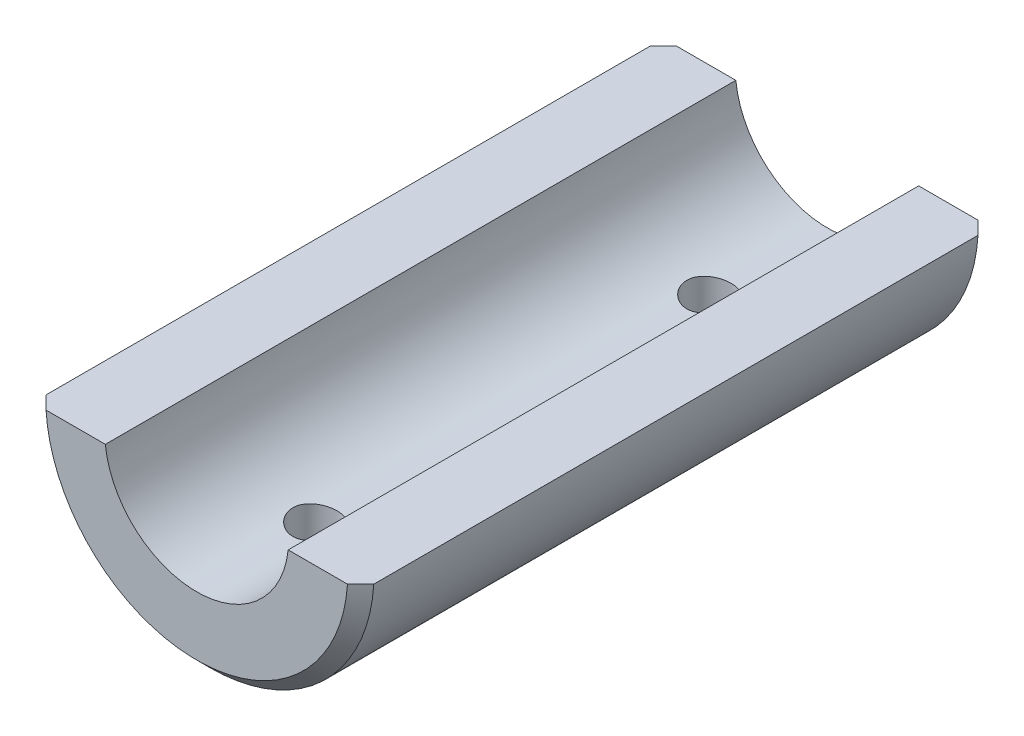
ISO-10303-21;
HEADER;
FILE_DESCRIPTION(('STEP AP214'),'2;1');
FILE_NAME('part.step','',(''),(''),'','','');
FILE_SCHEMA(('AUTOMOTIVE_DESIGN { 1 0 10303 214 1 1 1 1 }'));
ENDSEC;
DATA;
#1=APPLICATION_CONTEXT('core data for automotive mechanical design processes');
#2=APPLICATION_PROTOCOL_DEFINITION('international standard','automotive_design',2000,#1);
#3=PRODUCT_CONTEXT('',#1,'mechanical');
#4=PRODUCT('Part','Part','',(#3));
#5=PRODUCT_RELATED_PRODUCT_CATEGORY('part','',(#4));
#6=PRODUCT_DEFINITION_FORMATION('','',#4);
#7=PRODUCT_DEFINITION_CONTEXT('part definition',#1,'design');
#8=PRODUCT_DEFINITION('design','',#6,#7);
#9=PRODUCT_DEFINITION_SHAPE('','',#8);
#10=(LENGTH_UNIT() NAMED_UNIT(*) SI_UNIT(.MILLI.,.METRE.));
#11=(NAMED_UNIT(*) PLANE_ANGLE_UNIT() SI_UNIT($,.RADIAN.));
#12=(NAMED_UNIT(*) SI_UNIT($,.STERADIAN.) SOLID_ANGLE_UNIT());
#13=UNCERTAINTY_MEASURE_WITH_UNIT(LENGTH_MEASURE(1.E-05),#10,'distance_accuracy_value','');
#14=(GEOMETRIC_REPRESENTATION_CONTEXT(3) GLOBAL_UNCERTAINTY_ASSIGNED_CONTEXT((#13)) GLOBAL_UNIT_ASSIGNED_CONTEXT((#10,
#11,#12)) REPRESENTATION_CONTEXT('',''));
#15=CARTESIAN_POINT('',(0.,0.,0.));
#16=DIRECTION('',(0.,0.,1.));
#17=DIRECTION('',(1.,0.,0.));
#18=AXIS2_PLACEMENT_3D('',#15,#16,#17);
#19=CARTESIAN_POINT('',(0.,0.,96.));
#20=DIRECTION('',(0.,0.,-1.));
#21=DIRECTION('',(-1.,0.,0.));
#22=AXIS2_PLACEMENT_3D('',#19,#20,#21);
#23=CYLINDRICAL_SURFACE('',#22,14.);
#24=CARTESIAN_POINT('',(0.,-14.,21.375));
#25=CARTESIAN_POINT('',(-0.186684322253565,-13.9999967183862,21.3749943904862));
#26=CARTESIAN_POINT('',(-0.373432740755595,-13.9962285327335,21.3594584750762));
#27=CARTESIAN_POINT('',(-0.741591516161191,-13.9815612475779,21.2978098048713));
#28=CARTESIAN_POINT('',(-0.922998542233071,-13.970657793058,21.2516783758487));
#29=CARTESIAN_POINT('',(-1.27510361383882,-13.9429293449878,21.1303939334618));
#30=CARTESIAN_POINT('',(-1.44581376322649,-13.926111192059,21.0552744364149));
#31=CARTESIAN_POINT('',(-1.7722073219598,-13.8883515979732,20.8782607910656));
#32=CARTESIAN_POINT('',(-1.9278904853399,-13.8674100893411,20.7763662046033));
#33=CARTESIAN_POINT('',(-2.22280938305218,-13.8232327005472,20.5466217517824));
#34=CARTESIAN_POINT('',(-2.36171456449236,-13.799963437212,20.418353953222));
#35=CARTESIAN_POINT('',(-2.61626349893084,-13.7539788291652,20.1403996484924));
#36=CARTESIAN_POINT('',(-2.73190480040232,-13.7312635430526,19.9907108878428));
#37=CARTESIAN_POINT('',(-2.93816911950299,-13.6886245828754,19.6716337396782));
#38=CARTESIAN_POINT('',(-3.02842770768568,-13.668743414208,19.502003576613));
#39=CARTESIAN_POINT('',(-3.17902271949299,-13.6345083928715,19.1494223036));
#40=CARTESIAN_POINT('',(-3.23936356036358,-13.6201537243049,18.9664731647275));
#41=CARTESIAN_POINT('',(-3.32729300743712,-13.5989392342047,18.5960678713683));
#42=CARTESIAN_POINT('',(-3.35547331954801,-13.5919442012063,18.4087601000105));
#43=CARTESIAN_POINT('',(-3.38012392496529,-13.5858358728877,18.0319549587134));
#44=CARTESIAN_POINT('',(-3.3765989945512,-13.5867213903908,17.8424579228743));
#45=CARTESIAN_POINT('',(-3.33841247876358,-13.5961523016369,17.471146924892));
#46=CARTESIAN_POINT('',(-3.30445058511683,-13.6045255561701,17.2892559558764));
#47=CARTESIAN_POINT('',(-3.20746807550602,-13.6277148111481,16.9338322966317));
#48=CARTESIAN_POINT('',(-3.14444551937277,-13.6425312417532,16.7603001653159));
#49=CARTESIAN_POINT('',(-2.99052079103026,-13.6770988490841,16.4246169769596));
#50=CARTESIAN_POINT('',(-2.89936021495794,-13.6968954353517,16.2625892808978));
#51=CARTESIAN_POINT('',(-2.6919281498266,-13.7391664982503,15.9558773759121));
#52=CARTESIAN_POINT('',(-2.57565255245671,-13.7616414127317,15.8111960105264));
#53=CARTESIAN_POINT('',(-2.3176429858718,-13.8074657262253,15.5392682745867));
#54=CARTESIAN_POINT('',(-2.17531716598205,-13.8308225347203,15.4125840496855));
#55=CARTESIAN_POINT('',(-1.87116482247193,-13.8752414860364,15.1847792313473));
#56=CARTESIAN_POINT('',(-1.70933778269,-13.8963035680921,15.0836593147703));
#57=CARTESIAN_POINT('',(-1.37000932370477,-13.9338531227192,14.9096675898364));
#58=CARTESIAN_POINT('',(-1.19246214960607,-13.95032662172,14.8368818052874));
#59=CARTESIAN_POINT('',(-0.82716823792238,-13.9767407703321,14.7223423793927));
#60=CARTESIAN_POINT('',(-0.63942331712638,-13.9866825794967,14.6805832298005));
#61=CARTESIAN_POINT('',(-0.263874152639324,-13.9987435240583,14.6301287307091));
#62=CARTESIAN_POINT('',(-0.0761785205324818,-14.0010439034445,14.6206671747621));
#63=CARTESIAN_POINT('',(0.298113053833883,-13.9980765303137,14.6329823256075));
#64=CARTESIAN_POINT('',(0.48470908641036,-13.9928094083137,14.6547564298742));
#65=CARTESIAN_POINT('',(0.848879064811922,-13.9754144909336,14.7282919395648));
#66=CARTESIAN_POINT('',(1.02654137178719,-13.963381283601,14.7796401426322));
#67=CARTESIAN_POINT('',(1.37072476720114,-13.9338070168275,14.9103982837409));
#68=CARTESIAN_POINT('',(1.53724477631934,-13.9162654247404,14.9898109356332));
#69=CARTESIAN_POINT('',(1.85750116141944,-13.8771817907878,15.1759616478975));
#70=CARTESIAN_POINT('',(2.01097668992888,-13.8555776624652,15.2831351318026));
#71=CARTESIAN_POINT('',(2.29803782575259,-13.8108712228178,15.5212038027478));
#72=CARTESIAN_POINT('',(2.43162024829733,-13.7877686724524,15.652102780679));
#73=CARTESIAN_POINT('',(2.67822324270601,-13.7420244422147,15.9374531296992));
#74=CARTESIAN_POINT('',(2.79070820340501,-13.7194051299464,16.092371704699));
#75=CARTESIAN_POINT('',(2.98807774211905,-13.6777778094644,16.4193431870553));
#76=CARTESIAN_POINT('',(3.07296355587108,-13.6587696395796,16.5913953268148));
#77=CARTESIAN_POINT('',(3.21210478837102,-13.6267194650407,16.9468131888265));
#78=CARTESIAN_POINT('',(3.26654107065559,-13.6136423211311,17.1301047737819));
#79=CARTESIAN_POINT('',(3.34373365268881,-13.5948906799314,17.5035980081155));
#80=CARTESIAN_POINT('',(3.36649630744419,-13.5892146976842,17.6937982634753));
#81=CARTESIAN_POINT('',(3.37938125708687,-13.5860155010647,18.0702751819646));
#82=CARTESIAN_POINT('',(3.37035739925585,-13.5882790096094,18.2565212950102));
#83=CARTESIAN_POINT('',(3.3218661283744,-13.6002138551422,18.6247529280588));
#84=CARTESIAN_POINT('',(3.28239924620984,-13.6098850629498,18.8067385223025));
#85=CARTESIAN_POINT('',(3.17459316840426,-13.635431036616,19.160429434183));
#86=CARTESIAN_POINT('',(3.10640346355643,-13.6512736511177,19.332182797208));
#87=CARTESIAN_POINT('',(2.94320768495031,-13.6873840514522,19.6619289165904));
#88=CARTESIAN_POINT('',(2.84819815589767,-13.707652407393,19.8199198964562));
#89=CARTESIAN_POINT('',(2.63133680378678,-13.7509473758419,20.1218077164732));
#90=CARTESIAN_POINT('',(2.50888763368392,-13.7740291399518,20.2652676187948));
#91=CARTESIAN_POINT('',(2.24180110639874,-13.8200092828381,20.529881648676));
#92=CARTESIAN_POINT('',(2.09715853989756,-13.8429076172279,20.6510305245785));
#93=CARTESIAN_POINT('',(1.78690865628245,-13.8863914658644,20.8695248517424));
#94=CARTESIAN_POINT('',(1.62099457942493,-13.9069325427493,20.9664441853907));
#95=CARTESIAN_POINT('',(1.27475399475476,-13.9429263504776,21.1308617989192));
#96=CARTESIAN_POINT('',(1.09443847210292,-13.9583829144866,21.1983822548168));
#97=CARTESIAN_POINT('',(0.761903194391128,-13.980037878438,21.2914539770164));
#98=CARTESIAN_POINT('',(0.611337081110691,-13.9874738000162,21.3227184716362));
#99=CARTESIAN_POINT('',(0.307194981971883,-13.9974560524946,21.3644931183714));
#100=CARTESIAN_POINT('',(0.153619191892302,-14.0000027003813,21.3750046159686));
#101=CARTESIAN_POINT('',(0.,-14.,21.375));
#102=B_SPLINE_CURVE_WITH_KNOTS('',3,(#24,#25,#26,#27,#28,#29,#30,#31,#32,#33,#34,#35,#36,#37,
#38,#39,#40,#41,#42,#43,#44,#45,#46,#47,#48,#49,#50,#51,#52,#53,#54,#55,#56,#57,#58,#59,#60,#61,
#62,#63,#64,#65,#66,#67,#68,#69,#70,#71,#72,#73,#74,#75,#76,#77,#78,#79,#80,#81,#82,#83,#84,#85,
#86,#87,#88,#89,#90,#91,#92,#93,#94,#95,#96,#97,#98,#99,#100,#101),.UNSPECIFIED.,.T.,.F.,(4,2,2,
2,2,2,2,2,2,2,2,2,2,2,2,2,2,2,2,2,2,2,2,2,2,2,2,2,2,2,2,2,2,2,2,2,2,2,4),(0.,0.559490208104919,
1.11932222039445,1.67850887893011,2.23770468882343,2.80655967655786,3.37547457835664,
3.95218309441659,4.52880643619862,5.09464049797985,5.66038932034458,6.21345701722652,
6.76656164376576,7.32490491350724,7.8833395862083,8.45653974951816,9.02975508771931,
9.60469740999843,10.1795376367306,10.740642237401,11.3017000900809,11.8551028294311,
12.408559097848,12.9712858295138,13.5341025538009,14.1096957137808,14.6852630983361,
15.2573744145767,15.8293709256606,16.3861210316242,16.9428614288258,17.4967393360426,
18.050688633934,18.6181283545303,19.1857014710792,19.7626472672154,20.3391571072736,
20.7995814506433,21.2599759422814),.UNSPECIFIED.);
#103=CARTESIAN_POINT('',(0.,-14.,21.375));
#104=VERTEX_POINT('',#103);
#105=EDGE_CURVE('E99',#104,#104,#102,.T.);
#106=ORIENTED_EDGE('',*,*,#105,.T.);
#107=EDGE_LOOP('',(#106));
#108=FACE_BOUND('',#107,.T.);
#109=CARTESIAN_POINT('',(0.,-14.,81.375));
#110=CARTESIAN_POINT('',(-0.186684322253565,-13.9999967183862,81.3749943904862));
#111=CARTESIAN_POINT('',(-0.373432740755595,-13.9962285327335,81.3594584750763));
#112=CARTESIAN_POINT('',(-0.741591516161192,-13.9815612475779,81.2978098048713));
#113=CARTESIAN_POINT('',(-0.922998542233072,-13.970657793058,81.2516783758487));
#114=CARTESIAN_POINT('',(-1.27510361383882,-13.9429293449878,81.1303939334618));
#115=CARTESIAN_POINT('',(-1.4458137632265,-13.926111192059,81.0552744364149));
#116=CARTESIAN_POINT('',(-1.7722073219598,-13.8883515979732,80.8782607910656));
#117=CARTESIAN_POINT('',(-1.9278904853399,-13.8674100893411,80.7763662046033));
#118=CARTESIAN_POINT('',(-2.22280938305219,-13.8232327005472,80.5466217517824));
#119=CARTESIAN_POINT('',(-2.36171456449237,-13.799963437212,80.418353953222));
#120=CARTESIAN_POINT('',(-2.61626349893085,-13.7539788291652,80.1403996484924));
#121=CARTESIAN_POINT('',(-2.73190480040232,-13.7312635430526,79.9907108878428));
#122=CARTESIAN_POINT('',(-2.938169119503,-13.6886245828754,79.6716337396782));
#123=CARTESIAN_POINT('',(-3.02842770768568,-13.668743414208,79.502003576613));
#124=CARTESIAN_POINT('',(-3.179022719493,-13.6345083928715,79.1494223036));
#125=CARTESIAN_POINT('',(-3.23936356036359,-13.6201537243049,78.9664731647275));
#126=CARTESIAN_POINT('',(-3.32729300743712,-13.5989392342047,78.5960678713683));
#127=CARTESIAN_POINT('',(-3.35547331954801,-13.5919442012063,78.4087601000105));
#128=CARTESIAN_POINT('',(-3.38012392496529,-13.5858358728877,78.0319549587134));
#129=CARTESIAN_POINT('',(-3.3765989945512,-13.5867213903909,77.8424579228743));
#130=CARTESIAN_POINT('',(-3.33841247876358,-13.5961523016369,77.471146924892));
#131=CARTESIAN_POINT('',(-3.30445058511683,-13.6045255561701,77.2892559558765));
#132=CARTESIAN_POINT('',(-3.20746807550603,-13.6277148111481,76.9338322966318));
#133=CARTESIAN_POINT('',(-3.14444551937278,-13.6425312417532,76.760300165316));
#134=CARTESIAN_POINT('',(-2.99052079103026,-13.6770988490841,76.4246169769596));
#135=CARTESIAN_POINT('',(-2.89936021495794,-13.6968954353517,76.2625892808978));
#136=CARTESIAN_POINT('',(-2.6919281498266,-13.7391664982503,75.9558773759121));
#137=CARTESIAN_POINT('',(-2.57565255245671,-13.7616414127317,75.8111960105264));
#138=CARTESIAN_POINT('',(-2.3176429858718,-13.8074657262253,75.5392682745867));
#139=CARTESIAN_POINT('',(-2.17531716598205,-13.8308225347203,75.4125840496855));
#140=CARTESIAN_POINT('',(-1.87116482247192,-13.8752414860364,75.1847792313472));
#141=CARTESIAN_POINT('',(-1.70933778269,-13.8963035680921,75.0836593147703));
#142=CARTESIAN_POINT('',(-1.37000932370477,-13.9338531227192,74.9096675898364));
#143=CARTESIAN_POINT('',(-1.19246214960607,-13.95032662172,74.8368818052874));
#144=CARTESIAN_POINT('',(-0.827168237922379,-13.9767407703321,74.7223423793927));
#145=CARTESIAN_POINT('',(-0.639423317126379,-13.9866825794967,74.6805832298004));
#146=CARTESIAN_POINT('',(-0.263874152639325,-13.9987435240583,74.6301287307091));
#147=CARTESIAN_POINT('',(-0.0761785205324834,-14.0010439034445,74.6206671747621));
#148=CARTESIAN_POINT('',(0.298113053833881,-13.9980765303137,74.6329823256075));
#149=CARTESIAN_POINT('',(0.484709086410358,-13.9928094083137,74.6547564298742));
#150=CARTESIAN_POINT('',(0.84887906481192,-13.9754144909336,74.7282919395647));
#151=CARTESIAN_POINT('',(1.02654137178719,-13.963381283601,74.7796401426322));
#152=CARTESIAN_POINT('',(1.37072476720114,-13.9338070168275,74.9103982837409));
#153=CARTESIAN_POINT('',(1.53724477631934,-13.9162654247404,74.9898109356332));
#154=CARTESIAN_POINT('',(1.85750116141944,-13.8771817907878,75.1759616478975));
#155=CARTESIAN_POINT('',(2.01097668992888,-13.8555776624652,75.2831351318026));
#156=CARTESIAN_POINT('',(2.29803782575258,-13.8108712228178,75.5212038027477));
#157=CARTESIAN_POINT('',(2.43162024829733,-13.7877686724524,75.652102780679));
#158=CARTESIAN_POINT('',(2.67822324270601,-13.7420244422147,75.9374531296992));
#159=CARTESIAN_POINT('',(2.790708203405,-13.7194051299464,76.092371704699));
#160=CARTESIAN_POINT('',(2.98807774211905,-13.6777778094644,76.4193431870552));
#161=CARTESIAN_POINT('',(3.07296355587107,-13.6587696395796,76.5913953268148));
#162=CARTESIAN_POINT('',(3.21210478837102,-13.6267194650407,76.9468131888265));
#163=CARTESIAN_POINT('',(3.26654107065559,-13.6136423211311,77.1301047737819));
#164=CARTESIAN_POINT('',(3.34373365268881,-13.5948906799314,77.5035980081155));
#165=CARTESIAN_POINT('',(3.36649630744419,-13.5892146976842,77.6937982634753));
#166=CARTESIAN_POINT('',(3.37938125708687,-13.5860155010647,78.0702751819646));
#167=CARTESIAN_POINT('',(3.37035739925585,-13.5882790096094,78.2565212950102));
#168=CARTESIAN_POINT('',(3.3218661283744,-13.6002138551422,78.6247529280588));
#169=CARTESIAN_POINT('',(3.28239924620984,-13.6098850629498,78.8067385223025));
#170=CARTESIAN_POINT('',(3.17459316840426,-13.635431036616,79.160429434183));
#171=CARTESIAN_POINT('',(3.10640346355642,-13.6512736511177,79.332182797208));
#172=CARTESIAN_POINT('',(2.94320768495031,-13.6873840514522,79.6619289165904));
#173=CARTESIAN_POINT('',(2.84819815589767,-13.707652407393,79.8199198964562));
#174=CARTESIAN_POINT('',(2.63133680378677,-13.7509473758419,80.1218077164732));
#175=CARTESIAN_POINT('',(2.50888763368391,-13.7740291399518,80.2652676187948));
#176=CARTESIAN_POINT('',(2.24180110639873,-13.8200092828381,80.529881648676));
#177=CARTESIAN_POINT('',(2.09715853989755,-13.8429076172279,80.6510305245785));
#178=CARTESIAN_POINT('',(1.78690865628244,-13.8863914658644,80.8695248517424));
#179=CARTESIAN_POINT('',(1.62099457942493,-13.9069325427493,80.9664441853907));
#180=CARTESIAN_POINT('',(1.27475399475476,-13.9429263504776,81.1308617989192));
#181=CARTESIAN_POINT('',(1.09443847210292,-13.9583829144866,81.1983822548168));
#182=CARTESIAN_POINT('',(0.761903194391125,-13.980037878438,81.2914539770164));
#183=CARTESIAN_POINT('',(0.611337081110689,-13.9874738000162,81.3227184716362));
#184=CARTESIAN_POINT('',(0.307194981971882,-13.9974560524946,81.3644931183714));
#185=CARTESIAN_POINT('',(0.153619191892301,-14.0000027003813,81.3750046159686));
#186=CARTESIAN_POINT('',(0.,-14.,81.375));
#187=B_SPLINE_CURVE_WITH_KNOTS('',3,(#109,#110,#111,#112,#113,#114,#115,#116,#117,#118,#119,
#120,#121,#122,#123,#124,#125,#126,#127,#128,#129,#130,#131,#132,#133,#134,#135,#136,#137,#138,
#139,#140,#141,#142,#143,#144,#145,#146,#147,#148,#149,#150,#151,#152,#153,#154,#155,#156,#157,
#158,#159,#160,#161,#162,#163,#164,#165,#166,#167,#168,#169,#170,#171,#172,#173,#174,#175,#176,
#177,#178,#179,#180,#181,#182,#183,#184,#185,#186),.UNSPECIFIED.,.T.,.F.,(4,2,2,2,2,2,2,2,2,2,2,
2,2,2,2,2,2,2,2,2,2,2,2,2,2,2,2,2,2,2,2,2,2,2,2,2,2,2,4),(0.,0.559490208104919,1.11932222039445,
1.67850887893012,2.23770468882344,2.80655967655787,3.37547457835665,3.9521830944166,
4.52880643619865,5.09464049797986,5.66038932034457,6.2134570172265,6.76656164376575,
7.32490491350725,7.88333958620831,8.45653974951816,9.02975508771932,9.60469740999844,
10.1795376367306,10.740642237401,11.3017000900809,11.8551028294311,12.408559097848,
12.9712858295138,13.5341025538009,14.1096957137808,14.6852630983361,15.2573744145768,
15.8293709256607,16.3861210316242,16.9428614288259,17.4967393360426,18.050688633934,
18.6181283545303,19.1857014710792,19.7626472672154,20.3391571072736,20.7995814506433,
21.2599759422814),.UNSPECIFIED.);
#188=CARTESIAN_POINT('',(0.,-14.,81.375));
#189=VERTEX_POINT('',#188);
#190=EDGE_CURVE('E96',#189,#189,#187,.T.);
#191=ORIENTED_EDGE('',*,*,#190,.T.);
#192=EDGE_LOOP('',(#191));
#193=FACE_BOUND('',#192,.T.);
#194=CARTESIAN_POINT('',(0.,0.,0.));
#195=DIRECTION('',(0.,0.,-1.));
#196=DIRECTION('',(1.,0.,0.));
#197=AXIS2_PLACEMENT_3D('',#194,#195,#196);
#198=CIRCLE('',#197,14.);
#199=CARTESIAN_POINT('',(13.9194109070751,-1.5,0.));
#200=VERTEX_POINT('',#199);
#201=CARTESIAN_POINT('',(-13.9194109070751,-1.5,0.));
#202=VERTEX_POINT('',#201);
#203=EDGE_CURVE('E79',#200,#202,#198,.T.);
#204=ORIENTED_EDGE('',*,*,#203,.T.);
#205=DIRECTION('',(0.,0.,-1.));
#206=VECTOR('',#205,1.);
#207=CARTESIAN_POINT('',(-13.9194109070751,-1.5,96.));
#208=LINE('',#207,#206);
#209=CARTESIAN_POINT('',(-13.9194109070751,-1.5,96.));
#210=VERTEX_POINT('',#209);
#211=EDGE_CURVE('E83',#210,#202,#208,.T.);
#212=ORIENTED_EDGE('',*,*,#211,.F.);
#213=CARTESIAN_POINT('',(0.,0.,96.));
#214=DIRECTION('',(0.,0.,-1.));
#215=DIRECTION('',(1.,0.,0.));
#216=AXIS2_PLACEMENT_3D('',#213,#214,#215);
#217=CIRCLE('',#216,14.);
#218=CARTESIAN_POINT('',(13.9194109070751,-1.5,96.));
#219=VERTEX_POINT('',#218);
#220=EDGE_CURVE('E107',#219,#210,#217,.T.);
#221=ORIENTED_EDGE('',*,*,#220,.F.);
#222=DIRECTION('',(0.,0.,-1.));
#223=VECTOR('',#222,1.);
#224=CARTESIAN_POINT('',(13.9194109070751,-1.5,96.));
#225=LINE('',#224,#223);
#226=EDGE_CURVE('E95',#219,#200,#225,.T.);
#227=ORIENTED_EDGE('',*,*,#226,.T.);
#228=EDGE_LOOP('',(#204,#212,#221,#227));
#229=FACE_BOUND('',#228,.T.);
#230=ADVANCED_FACE('F24',(#108,#193,#229),#23,.F.);
#231=CARTESIAN_POINT('',(-24.9549594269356,-1.5,96.));
#232=DIRECTION('',(0.,-1.,0.));
#233=DIRECTION('',(0.,0.,-1.));
#234=AXIS2_PLACEMENT_3D('',#231,#232,#233);
#235=PLANE('',#234);
#236=DIRECTION('',(0.,0.,-1.));
#237=VECTOR('',#236,1.);
#238=CARTESIAN_POINT('',(-24.9549594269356,-1.49999999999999,96.));
#239=LINE('',#238,#237);
#240=CARTESIAN_POINT('',(-24.9549594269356,-1.49999999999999,94.));
#241=VERTEX_POINT('',#240);
#242=CARTESIAN_POINT('',(-24.9549594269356,-1.49999999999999,2.));
#243=VERTEX_POINT('',#242);
#244=EDGE_CURVE('E91',#241,#243,#239,.T.);
#245=ORIENTED_EDGE('',*,*,#244,.F.);
#246=CARTESIAN_POINT('',(-24.9549594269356,-1.49999999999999,94.));
#247=CARTESIAN_POINT('',(-24.6209992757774,-1.5,94.3333606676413));
#248=CARTESIAN_POINT('',(-24.28702548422,-1.5,94.666707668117));
#249=CARTESIAN_POINT('',(-23.6190506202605,-1.5,95.3333743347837));
#250=CARTESIAN_POINT('',(-23.2850495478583,-1.5,95.6666940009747));
#251=CARTESIAN_POINT('',(-22.951034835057,-1.5,96.));
#252=B_SPLINE_CURVE_WITH_KNOTS('',3,(#246,#247,#248,#249,#250,#251),.UNSPECIFIED.,.F.,.F.,(4,2,
4),(0.,1.41560179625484,2.83120359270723),.UNSPECIFIED.);
#253=CARTESIAN_POINT('',(-22.951034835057,-1.5,96.));
#254=VERTEX_POINT('',#253);
#255=EDGE_CURVE('E32',#241,#254,#252,.T.);
#256=ORIENTED_EDGE('',*,*,#255,.T.);
#257=DIRECTION('',(-1.,0.,0.));
#258=VECTOR('',#257,1.);
#259=CARTESIAN_POINT('',(-24.9549594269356,-1.5,96.));
#260=LINE('',#259,#258);
#261=EDGE_CURVE('E86',#210,#254,#260,.T.);
#262=ORIENTED_EDGE('',*,*,#261,.F.);
#263=ORIENTED_EDGE('',*,*,#211,.T.);
#264=DIRECTION('',(-1.,0.,0.));
#265=VECTOR('',#264,1.);
#266=CARTESIAN_POINT('',(-24.9549594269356,-1.5,0.));
#267=LINE('',#266,#265);
#268=CARTESIAN_POINT('',(-22.951034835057,-1.5,0.));
#269=VERTEX_POINT('',#268);
#270=EDGE_CURVE('E75',#202,#269,#267,.T.);
#271=ORIENTED_EDGE('',*,*,#270,.T.);
#272=CARTESIAN_POINT('',(-22.951034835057,-1.5,0.));
#273=CARTESIAN_POINT('',(-23.2850495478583,-1.5,0.333305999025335));
#274=CARTESIAN_POINT('',(-23.6190506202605,-1.5,0.6666256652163));
#275=CARTESIAN_POINT('',(-24.28702548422,-1.5,1.33329233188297));
#276=CARTESIAN_POINT('',(-24.6209992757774,-1.5,1.66663933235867));
#277=CARTESIAN_POINT('',(-24.9549594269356,-1.5,2.));
#278=B_SPLINE_CURVE_WITH_KNOTS('',3,(#272,#273,#274,#275,#276,#277),.UNSPECIFIED.,.F.,.F.,(4,2,
4),(0.,1.41560179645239,2.83120359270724),.UNSPECIFIED.);
#279=EDGE_CURVE('E44',#269,#243,#278,.T.);
#280=ORIENTED_EDGE('',*,*,#279,.T.);
#281=EDGE_LOOP('',(#245,#256,#262,#263,#271,#280));
#282=FACE_BOUND('',#281,.T.);
#283=ADVANCED_FACE('F84',(#282),#235,.F.);
#284=CARTESIAN_POINT('',(0.,0.,96.));
#285=DIRECTION('',(0.,0.,-1.));
#286=DIRECTION('',(-1.,0.,0.));
#287=AXIS2_PLACEMENT_3D('',#284,#285,#286);
#288=CYLINDRICAL_SURFACE('',#287,25.);
#289=CARTESIAN_POINT('',(0.,-25.,21.375));
#290=CARTESIAN_POINT('',(0.188654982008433,-24.9999972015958,21.37499206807));
#291=CARTESIAN_POINT('',(0.377424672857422,-24.9978420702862,21.3591285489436));
#292=CARTESIAN_POINT('',(0.749702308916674,-24.9894521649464,21.2961013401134));
#293=CARTESIAN_POINT('',(0.933204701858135,-24.9832132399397,21.2489058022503));
#294=CARTESIAN_POINT('',(1.2895050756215,-24.9673579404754,21.124638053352));
#295=CARTESIAN_POINT('',(1.46231049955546,-24.9577439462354,21.0475868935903));
#296=CARTESIAN_POINT('',(1.79250803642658,-24.9362051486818,20.8658432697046));
#297=CARTESIAN_POINT('',(1.94990259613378,-24.9242807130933,20.7611552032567));
#298=CARTESIAN_POINT('',(2.24584527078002,-24.8993652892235,20.5263963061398));
#299=CARTESIAN_POINT('',(2.38428083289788,-24.8863686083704,20.3961841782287));
#300=CARTESIAN_POINT('',(2.63740579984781,-24.8608188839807,20.1143771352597));
#301=CARTESIAN_POINT('',(2.75209393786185,-24.8482658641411,19.9627810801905));
#302=CARTESIAN_POINT('',(2.95489524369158,-24.8249691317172,19.6417681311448));
#303=CARTESIAN_POINT('',(3.04290159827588,-24.8142327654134,19.4722831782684));
#304=CARTESIAN_POINT('',(3.18915886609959,-24.7958611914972,19.1207695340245));
#305=CARTESIAN_POINT('',(3.24741109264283,-24.7882258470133,18.9387413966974));
#306=CARTESIAN_POINT('',(3.33216150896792,-24.7769758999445,18.568483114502));
#307=CARTESIAN_POINT('',(3.35885083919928,-24.7733371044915,18.3802974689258));
#308=CARTESIAN_POINT('',(3.380309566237,-24.7704184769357,18.0020858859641));
#309=CARTESIAN_POINT('',(3.37508045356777,-24.7711384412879,17.8120600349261));
#310=CARTESIAN_POINT('',(3.33300736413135,-24.7768338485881,17.4369010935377));
#311=CARTESIAN_POINT('',(3.29637481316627,-24.781780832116,17.2517437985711));
#312=CARTESIAN_POINT('',(3.19286499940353,-24.795328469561,16.8902285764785));
#313=CARTESIAN_POINT('',(3.12598703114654,-24.8039292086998,16.7138708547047));
#314=CARTESIAN_POINT('',(2.96366035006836,-24.8238472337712,16.3743092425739));
#315=CARTESIAN_POINT('',(2.86812064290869,-24.8351731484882,16.2111493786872));
#316=CARTESIAN_POINT('',(2.65124748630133,-24.8592588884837,15.9030977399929));
#317=CARTESIAN_POINT('',(2.52991266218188,-24.872018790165,15.7582069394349));
#318=CARTESIAN_POINT('',(2.26372602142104,-24.8976610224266,15.4895798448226));
#319=CARTESIAN_POINT('',(2.1186921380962,-24.9105435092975,15.3660239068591));
#320=CARTESIAN_POINT('',(1.80984882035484,-24.9348832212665,15.1449811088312));
#321=CARTESIAN_POINT('',(1.64603932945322,-24.9463404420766,15.047494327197));
#322=CARTESIAN_POINT('',(1.30414913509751,-24.9665475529,14.8813535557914));
#323=CARTESIAN_POINT('',(1.12606238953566,-24.975296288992,14.8127118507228));
#324=CARTESIAN_POINT('',(0.76074571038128,-24.9890905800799,14.7063580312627));
#325=CARTESIAN_POINT('',(0.573516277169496,-24.9941363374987,14.6686442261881));
#326=CARTESIAN_POINT('',(0.196787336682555,-24.9999296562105,14.6254528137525));
#327=CARTESIAN_POINT('',(0.00731678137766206,-25.0007103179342,14.6197269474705));
#328=CARTESIAN_POINT('',(-0.369881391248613,-24.9979751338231,14.6400173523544));
#329=CARTESIAN_POINT('',(-0.557609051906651,-24.9944593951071,14.6660328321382));
#330=CARTESIAN_POINT('',(-0.925252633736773,-24.9835469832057,14.7488611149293));
#331=CARTESIAN_POINT('',(-1.10519592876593,-24.9761653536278,14.8055545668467));
#332=CARTESIAN_POINT('',(-1.45302188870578,-24.9583469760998,14.9480047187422));
#333=CARTESIAN_POINT('',(-1.62090408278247,-24.9479101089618,15.0337625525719));
#334=CARTESIAN_POINT('',(-1.94094458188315,-24.9250608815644,15.2325008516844));
#335=CARTESIAN_POINT('',(-2.09300306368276,-24.9126371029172,15.345640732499));
#336=CARTESIAN_POINT('',(-2.37606179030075,-24.8872369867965,15.5957073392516));
#337=CARTESIAN_POINT('',(-2.50706105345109,-24.8742606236,15.732635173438));
#338=CARTESIAN_POINT('',(-2.74517214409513,-24.8491146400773,16.0274888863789));
#339=CARTESIAN_POINT('',(-2.85211868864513,-24.8369509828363,16.1855488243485));
#340=CARTESIAN_POINT('',(-3.03794403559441,-24.8149086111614,16.5175342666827));
#341=CARTESIAN_POINT('',(-3.11682347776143,-24.805029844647,16.6914594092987));
#342=CARTESIAN_POINT('',(-3.2440122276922,-24.788717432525,17.0497202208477));
#343=CARTESIAN_POINT('',(-3.29241236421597,-24.7822735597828,17.2340231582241));
#344=CARTESIAN_POINT('',(-3.35755989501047,-24.7735320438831,17.6082337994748));
#345=CARTESIAN_POINT('',(-3.37430902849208,-24.7712341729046,17.7981411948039));
#346=CARTESIAN_POINT('',(-3.37564360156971,-24.7710522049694,18.1765245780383));
#347=CARTESIAN_POINT('',(-3.36048876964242,-24.7731324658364,18.3649996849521));
#348=CARTESIAN_POINT('',(-3.29899809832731,-24.7813954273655,18.7366965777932));
#349=CARTESIAN_POINT('',(-3.25266227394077,-24.7875781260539,18.9199183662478));
#350=CARTESIAN_POINT('',(-3.13021024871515,-24.8033377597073,19.2758590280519));
#351=CARTESIAN_POINT('',(-3.05410871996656,-24.8129130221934,19.4485830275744));
#352=CARTESIAN_POINT('',(-2.8743110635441,-24.8343813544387,19.7788523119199));
#353=CARTESIAN_POINT('',(-2.77061436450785,-24.8462744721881,19.9363972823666));
#354=CARTESIAN_POINT('',(-2.53761355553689,-24.8711542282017,20.2331612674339));
#355=CARTESIAN_POINT('',(-2.4081162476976,-24.8841486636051,20.3722279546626));
#356=CARTESIAN_POINT('',(-2.12759641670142,-24.9096994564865,20.6267530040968));
#357=CARTESIAN_POINT('',(-1.97656885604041,-24.9222557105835,20.7422058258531));
#358=CARTESIAN_POINT('',(-1.6564992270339,-24.9455777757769,20.9466707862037));
#359=CARTESIAN_POINT('',(-1.48738032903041,-24.9563354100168,21.0355635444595));
#360=CARTESIAN_POINT('',(-1.13655776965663,-24.9747666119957,21.1835560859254));
#361=CARTESIAN_POINT('',(-0.95486777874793,-24.9824434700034,21.2426876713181));
#362=CARTESIAN_POINT('',(-0.643569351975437,-24.9920344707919,21.3156030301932));
#363=CARTESIAN_POINT('',(-0.515909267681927,-24.9950066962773,21.3378441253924));
#364=CARTESIAN_POINT('',(-0.258850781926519,-24.9989904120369,21.3675452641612));
#365=CARTESIAN_POINT('',(-0.129452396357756,-25.0000019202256,21.3750054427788));
#366=CARTESIAN_POINT('',(0.,-25.,21.375));
#367=B_SPLINE_CURVE_WITH_KNOTS('',3,(#289,#290,#291,#292,#293,#294,#295,#296,#297,#298,#299,
#300,#301,#302,#303,#304,#305,#306,#307,#308,#309,#310,#311,#312,#313,#314,#315,#316,#317,#318,
#319,#320,#321,#322,#323,#324,#325,#326,#327,#328,#329,#330,#331,#332,#333,#334,#335,#336,#337,
#338,#339,#340,#341,#342,#343,#344,#345,#346,#347,#348,#349,#350,#351,#352,#353,#354,#355,#356,
#357,#358,#359,#360,#361,#362,#363,#364,#365,#366),.UNSPECIFIED.,.T.,.F.,(4,2,2,2,2,2,2,2,2,2,2,
2,2,2,2,2,2,2,2,2,2,2,2,2,2,2,2,2,2,2,2,2,2,2,2,2,2,2,4),(0.,0.565492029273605,1.13155974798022,
1.69722905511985,2.2628084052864,2.83161195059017,3.40044583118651,3.97152769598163,
4.54258435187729,5.11016476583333,5.67771867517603,6.24148123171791,6.8052569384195,
7.37084179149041,7.93645679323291,8.50664120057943,9.07682732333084,9.6472560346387,
10.2176535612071,10.7836180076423,11.3495683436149,11.9133325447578,12.4771187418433,
13.044269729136,13.6114471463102,14.1824104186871,14.753360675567,15.3226013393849,
15.8918107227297,16.4564041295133,17.0209972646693,17.5853124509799,18.1496393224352,
18.7183625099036,19.2872189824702,19.8585951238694,20.4293594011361,20.8173956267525,
21.2054283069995),.UNSPECIFIED.);
#368=CARTESIAN_POINT('',(0.,-25.,21.375));
#369=VERTEX_POINT('',#368);
#370=EDGE_CURVE('E122',#369,#369,#367,.T.);
#371=ORIENTED_EDGE('',*,*,#370,.T.);
#372=EDGE_LOOP('',(#371));
#373=FACE_BOUND('',#372,.T.);
#374=CARTESIAN_POINT('',(0.,-25.,81.375));
#375=CARTESIAN_POINT('',(0.188654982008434,-24.9999972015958,81.37499206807));
#376=CARTESIAN_POINT('',(0.377424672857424,-24.9978420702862,81.3591285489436));
#377=CARTESIAN_POINT('',(0.749702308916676,-24.9894521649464,81.2961013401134));
#378=CARTESIAN_POINT('',(0.933204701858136,-24.9832132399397,81.2489058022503));
#379=CARTESIAN_POINT('',(1.2895050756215,-24.9673579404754,81.124638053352));
#380=CARTESIAN_POINT('',(1.46231049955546,-24.9577439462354,81.0475868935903));
#381=CARTESIAN_POINT('',(1.79250803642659,-24.9362051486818,80.8658432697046));
#382=CARTESIAN_POINT('',(1.94990259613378,-24.9242807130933,80.7611552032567));
#383=CARTESIAN_POINT('',(2.24584527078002,-24.8993652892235,80.5263963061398));
#384=CARTESIAN_POINT('',(2.38428083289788,-24.8863686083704,80.3961841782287));
#385=CARTESIAN_POINT('',(2.63740579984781,-24.8608188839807,80.1143771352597));
#386=CARTESIAN_POINT('',(2.75209393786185,-24.8482658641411,79.9627810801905));
#387=CARTESIAN_POINT('',(2.95489524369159,-24.8249691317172,79.6417681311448));
#388=CARTESIAN_POINT('',(3.04290159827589,-24.8142327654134,79.4722831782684));
#389=CARTESIAN_POINT('',(3.1891588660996,-24.7958611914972,79.1207695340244));
#390=CARTESIAN_POINT('',(3.24741109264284,-24.7882258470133,78.9387413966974));
#391=CARTESIAN_POINT('',(3.33216150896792,-24.7769758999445,78.568483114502));
#392=CARTESIAN_POINT('',(3.35885083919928,-24.7733371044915,78.3802974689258));
#393=CARTESIAN_POINT('',(3.38030956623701,-24.7704184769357,78.0020858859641));
#394=CARTESIAN_POINT('',(3.37508045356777,-24.7711384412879,77.8120600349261));
#395=CARTESIAN_POINT('',(3.33300736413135,-24.7768338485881,77.4369010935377));
#396=CARTESIAN_POINT('',(3.29637481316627,-24.781780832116,77.251743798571));
#397=CARTESIAN_POINT('',(3.19286499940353,-24.795328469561,76.8902285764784));
#398=CARTESIAN_POINT('',(3.12598703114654,-24.8039292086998,76.7138708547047));
#399=CARTESIAN_POINT('',(2.96366035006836,-24.8238472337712,76.3743092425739));
#400=CARTESIAN_POINT('',(2.86812064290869,-24.8351731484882,76.2111493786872));
#401=CARTESIAN_POINT('',(2.65124748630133,-24.8592588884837,75.9030977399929));
#402=CARTESIAN_POINT('',(2.52991266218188,-24.872018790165,75.7582069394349));
#403=CARTESIAN_POINT('',(2.26372602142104,-24.8976610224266,75.4895798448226));
#404=CARTESIAN_POINT('',(2.1186921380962,-24.9105435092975,75.3660239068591));
#405=CARTESIAN_POINT('',(1.80984882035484,-24.9348832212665,75.1449811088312));
#406=CARTESIAN_POINT('',(1.64603932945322,-24.9463404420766,75.0474943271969));
#407=CARTESIAN_POINT('',(1.3041491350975,-24.9665475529,74.8813535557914));
#408=CARTESIAN_POINT('',(1.12606238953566,-24.975296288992,74.8127118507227));
#409=CARTESIAN_POINT('',(0.760745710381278,-24.9890905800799,74.7063580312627));
#410=CARTESIAN_POINT('',(0.573516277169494,-24.9941363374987,74.6686442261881));
#411=CARTESIAN_POINT('',(0.196787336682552,-24.9999296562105,74.6254528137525));
#412=CARTESIAN_POINT('',(0.0073167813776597,-25.0007103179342,74.6197269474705));
#413=CARTESIAN_POINT('',(-0.369881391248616,-24.9979751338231,74.6400173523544));
#414=CARTESIAN_POINT('',(-0.557609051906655,-24.9944593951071,74.6660328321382));
#415=CARTESIAN_POINT('',(-0.925252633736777,-24.9835469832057,74.7488611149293));
#416=CARTESIAN_POINT('',(-1.10519592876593,-24.9761653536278,74.8055545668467));
#417=CARTESIAN_POINT('',(-1.45302188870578,-24.9583469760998,74.9480047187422));
#418=CARTESIAN_POINT('',(-1.62090408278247,-24.9479101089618,75.0337625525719));
#419=CARTESIAN_POINT('',(-1.94094458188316,-24.9250608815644,75.2325008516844));
#420=CARTESIAN_POINT('',(-2.09300306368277,-24.9126371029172,75.345640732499));
#421=CARTESIAN_POINT('',(-2.37606179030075,-24.8872369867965,75.5957073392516));
#422=CARTESIAN_POINT('',(-2.50706105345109,-24.8742606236,75.7326351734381));
#423=CARTESIAN_POINT('',(-2.74517214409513,-24.8491146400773,76.0274888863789));
#424=CARTESIAN_POINT('',(-2.85211868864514,-24.8369509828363,76.1855488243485));
#425=CARTESIAN_POINT('',(-3.03794403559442,-24.8149086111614,76.5175342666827));
#426=CARTESIAN_POINT('',(-3.11682347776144,-24.805029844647,76.6914594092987));
#427=CARTESIAN_POINT('',(-3.2440122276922,-24.788717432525,77.0497202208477));
#428=CARTESIAN_POINT('',(-3.29241236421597,-24.7822735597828,77.2340231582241));
#429=CARTESIAN_POINT('',(-3.35755989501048,-24.7735320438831,77.6082337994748));
#430=CARTESIAN_POINT('',(-3.37430902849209,-24.7712341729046,77.7981411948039));
#431=CARTESIAN_POINT('',(-3.37564360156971,-24.7710522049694,78.1765245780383));
#432=CARTESIAN_POINT('',(-3.36048876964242,-24.7731324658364,78.3649996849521));
#433=CARTESIAN_POINT('',(-3.2989980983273,-24.7813954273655,78.7366965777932));
#434=CARTESIAN_POINT('',(-3.25266227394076,-24.7875781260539,78.9199183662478));
#435=CARTESIAN_POINT('',(-3.13021024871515,-24.8033377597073,79.2758590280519));
#436=CARTESIAN_POINT('',(-3.05410871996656,-24.8129130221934,79.4485830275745));
#437=CARTESIAN_POINT('',(-2.8743110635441,-24.8343813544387,79.7788523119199));
#438=CARTESIAN_POINT('',(-2.77061436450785,-24.8462744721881,79.9363972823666));
#439=CARTESIAN_POINT('',(-2.53761355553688,-24.8711542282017,80.2331612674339));
#440=CARTESIAN_POINT('',(-2.4081162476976,-24.8841486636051,80.3722279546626));
#441=CARTESIAN_POINT('',(-2.12759641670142,-24.9096994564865,80.6267530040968));
#442=CARTESIAN_POINT('',(-1.97656885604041,-24.9222557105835,80.7422058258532));
#443=CARTESIAN_POINT('',(-1.6564992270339,-24.9455777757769,80.9466707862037));
#444=CARTESIAN_POINT('',(-1.48738032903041,-24.9563354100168,81.0355635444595));
#445=CARTESIAN_POINT('',(-1.13655776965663,-24.9747666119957,81.1835560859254));
#446=CARTESIAN_POINT('',(-0.954867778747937,-24.9824434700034,81.2426876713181));
#447=CARTESIAN_POINT('',(-0.643569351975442,-24.9920344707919,81.3156030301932));
#448=CARTESIAN_POINT('',(-0.515909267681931,-24.9950066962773,81.3378441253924));
#449=CARTESIAN_POINT('',(-0.258850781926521,-24.9989904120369,81.3675452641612));
#450=CARTESIAN_POINT('',(-0.129452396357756,-25.0000019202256,81.3750054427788));
#451=CARTESIAN_POINT('',(0.,-25.,81.375));
#452=B_SPLINE_CURVE_WITH_KNOTS('',3,(#374,#375,#376,#377,#378,#379,#380,#381,#382,#383,#384,
#385,#386,#387,#388,#389,#390,#391,#392,#393,#394,#395,#396,#397,#398,#399,#400,#401,#402,#403,
#404,#405,#406,#407,#408,#409,#410,#411,#412,#413,#414,#415,#416,#417,#418,#419,#420,#421,#422,
#423,#424,#425,#426,#427,#428,#429,#430,#431,#432,#433,#434,#435,#436,#437,#438,#439,#440,#441,
#442,#443,#444,#445,#446,#447,#448,#449,#450,#451),.UNSPECIFIED.,.T.,.F.,(4,2,2,2,2,2,2,2,2,2,2,
2,2,2,2,2,2,2,2,2,2,2,2,2,2,2,2,2,2,2,2,2,2,2,2,2,2,2,4),(0.,0.565492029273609,1.13155974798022,
1.69722905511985,2.2628084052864,2.83161195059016,3.40044583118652,3.97152769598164,
4.54258435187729,5.11016476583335,5.67771867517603,6.24148123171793,6.80525693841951,
7.37084179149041,7.9364567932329,8.50664120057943,9.07682732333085,9.6472560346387,
10.2176535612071,10.7836180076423,11.3495683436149,11.9133325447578,12.4771187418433,
13.044269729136,13.6114471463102,14.1824104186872,14.7533606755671,15.3226013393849,
15.8918107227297,16.4564041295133,17.0209972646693,17.58531245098,18.1496393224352,
18.7183625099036,19.2872189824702,19.8585951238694,20.4293594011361,20.8173956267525,
21.2054283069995),.UNSPECIFIED.);
#453=CARTESIAN_POINT('',(0.,-25.,81.375));
#454=VERTEX_POINT('',#453);
#455=EDGE_CURVE('E90',#454,#454,#452,.T.);
#456=ORIENTED_EDGE('',*,*,#455,.T.);
#457=EDGE_LOOP('',(#456));
#458=FACE_BOUND('',#457,.T.);
#459=DIRECTION('',(0.,0.,-1.));
#460=VECTOR('',#459,1.);
#461=CARTESIAN_POINT('',(24.9549594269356,-1.5,96.));
#462=LINE('',#461,#460);
#463=CARTESIAN_POINT('',(24.9549594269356,-1.5,94.));
#464=VERTEX_POINT('',#463);
#465=CARTESIAN_POINT('',(24.9549594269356,-1.5,2.));
#466=VERTEX_POINT('',#465);
#467=EDGE_CURVE('E113',#464,#466,#462,.T.);
#468=ORIENTED_EDGE('',*,*,#467,.F.);
#469=CARTESIAN_POINT('',(0.,0.,94.));
#470=DIRECTION('',(0.,0.,1.));
#471=DIRECTION('',(1.,0.,0.));
#472=AXIS2_PLACEMENT_3D('',#469,#470,#471);
#473=CIRCLE('',#472,25.);
#474=EDGE_CURVE('E210',#464,#241,#473,.F.);
#475=ORIENTED_EDGE('',*,*,#474,.T.);
#476=ORIENTED_EDGE('',*,*,#244,.T.);
#477=CARTESIAN_POINT('',(0.,0.,2.));
#478=DIRECTION('',(0.,0.,1.));
#479=DIRECTION('',(1.,0.,0.));
#480=AXIS2_PLACEMENT_3D('',#477,#478,#479);
#481=CIRCLE('',#480,25.);
#482=EDGE_CURVE('E161',#243,#466,#481,.T.);
#483=ORIENTED_EDGE('',*,*,#482,.T.);
#484=EDGE_LOOP('',(#468,#475,#476,#483));
#485=FACE_BOUND('',#484,.T.);
#486=ADVANCED_FACE('F127',(#373,#458,#485),#288,.T.);
#487=CARTESIAN_POINT('',(13.9194109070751,-1.5,96.));
#488=DIRECTION('',(0.,-1.,0.));
#489=DIRECTION('',(0.,0.,-1.));
#490=AXIS2_PLACEMENT_3D('',#487,#488,#489);
#491=PLANE('',#490);
#492=DIRECTION('',(-1.,0.,0.));
#493=VECTOR('',#492,1.);
#494=CARTESIAN_POINT('',(13.9194109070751,-1.5,96.));
#495=LINE('',#494,#493);
#496=CARTESIAN_POINT('',(22.951034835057,-1.5,96.));
#497=VERTEX_POINT('',#496);
#498=EDGE_CURVE('E110',#497,#219,#495,.T.);
#499=ORIENTED_EDGE('',*,*,#498,.F.);
#500=CARTESIAN_POINT('',(22.951034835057,-1.5,96.));
#501=CARTESIAN_POINT('',(23.2850495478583,-1.5,95.6666940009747));
#502=CARTESIAN_POINT('',(23.6190506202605,-1.5,95.3333743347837));
#503=CARTESIAN_POINT('',(24.28702548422,-1.5,94.666707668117));
#504=CARTESIAN_POINT('',(24.6209992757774,-1.5,94.3333606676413));
#505=CARTESIAN_POINT('',(24.9549594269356,-1.5,94.));
#506=B_SPLINE_CURVE_WITH_KNOTS('',3,(#500,#501,#502,#503,#504,#505),.UNSPECIFIED.,.F.,.F.,(4,2,
4),(0.,1.41560179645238,2.83120359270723),.UNSPECIFIED.);
#507=EDGE_CURVE('E156',#497,#464,#506,.T.);
#508=ORIENTED_EDGE('',*,*,#507,.T.);
#509=ORIENTED_EDGE('',*,*,#467,.T.);
#510=CARTESIAN_POINT('',(24.9549594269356,-1.5,2.));
#511=CARTESIAN_POINT('',(24.6209992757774,-1.5,1.66663933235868));
#512=CARTESIAN_POINT('',(24.28702548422,-1.5,1.33329233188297));
#513=CARTESIAN_POINT('',(23.6190506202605,-1.5,0.666625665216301));
#514=CARTESIAN_POINT('',(23.2850495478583,-1.5,0.333305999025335));
#515=CARTESIAN_POINT('',(22.951034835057,-1.5,0.));
#516=B_SPLINE_CURVE_WITH_KNOTS('',3,(#510,#511,#512,#513,#514,#515),.UNSPECIFIED.,.F.,.F.,(4,2,
4),(0.,1.41560179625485,2.83120359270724),.UNSPECIFIED.);
#517=CARTESIAN_POINT('',(22.951034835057,-1.5,0.));
#518=VERTEX_POINT('',#517);
#519=EDGE_CURVE('E150',#466,#518,#516,.T.);
#520=ORIENTED_EDGE('',*,*,#519,.T.);
#521=DIRECTION('',(-1.,0.,0.));
#522=VECTOR('',#521,1.);
#523=CARTESIAN_POINT('',(13.9194109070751,-1.5,0.));
#524=LINE('',#523,#522);
#525=EDGE_CURVE('E80',#518,#200,#524,.T.);
#526=ORIENTED_EDGE('',*,*,#525,.T.);
#527=ORIENTED_EDGE('',*,*,#226,.F.);
#528=EDGE_LOOP('',(#499,#508,#509,#520,#526,#527));
#529=FACE_BOUND('',#528,.T.);
#530=ADVANCED_FACE('F143',(#529),#491,.F.);
#531=CARTESIAN_POINT('',(0.,0.,96.));
#532=DIRECTION('',(0.,0.,1.));
#533=DIRECTION('',(1.,0.,0.));
#534=AXIS2_PLACEMENT_3D('',#531,#532,#533);
#535=PLANE('',#534);
#536=ORIENTED_EDGE('',*,*,#261,.T.);
#537=CARTESIAN_POINT('',(0.,0.,96.));
#538=DIRECTION('',(0.,0.,1.));
#539=DIRECTION('',(1.,0.,0.));
#540=AXIS2_PLACEMENT_3D('',#537,#538,#539);
#541=CIRCLE('',#540,23.);
#542=EDGE_CURVE('E202',#254,#497,#541,.T.);
#543=ORIENTED_EDGE('',*,*,#542,.T.);
#544=ORIENTED_EDGE('',*,*,#498,.T.);
#545=ORIENTED_EDGE('',*,*,#220,.T.);
#546=EDGE_LOOP('',(#536,#543,#544,#545));
#547=FACE_BOUND('',#546,.T.);
#548=ADVANCED_FACE('F141',(#547),#535,.T.);
#549=CARTESIAN_POINT('',(0.,0.,0.));
#550=DIRECTION('',(0.,0.,1.));
#551=DIRECTION('',(1.,0.,0.));
#552=AXIS2_PLACEMENT_3D('',#549,#550,#551);
#553=PLANE('',#552);
#554=ORIENTED_EDGE('',*,*,#525,.F.);
#555=CARTESIAN_POINT('',(0.,0.,0.));
#556=DIRECTION('',(0.,0.,1.));
#557=DIRECTION('',(1.,0.,0.));
#558=AXIS2_PLACEMENT_3D('',#555,#556,#557);
#559=CIRCLE('',#558,23.);
#560=EDGE_CURVE('E11',#518,#269,#559,.F.);
#561=ORIENTED_EDGE('',*,*,#560,.T.);
#562=ORIENTED_EDGE('',*,*,#270,.F.);
#563=ORIENTED_EDGE('',*,*,#203,.F.);
#564=EDGE_LOOP('',(#554,#561,#562,#563));
#565=FACE_BOUND('',#564,.T.);
#566=ADVANCED_FACE('F77',(#565),#553,.F.);
#567=CARTESIAN_POINT('',(0.,-25.,78.));
#568=DIRECTION('',(0.,1.,0.));
#569=DIRECTION('',(0.,0.,1.));
#570=AXIS2_PLACEMENT_3D('',#567,#568,#569);
#571=CYLINDRICAL_SURFACE('',#570,3.375);
#572=ORIENTED_EDGE('',*,*,#455,.F.);
#573=EDGE_LOOP('',(#572));
#574=FACE_BOUND('',#573,.T.);
#575=ORIENTED_EDGE('',*,*,#190,.F.);
#576=EDGE_LOOP('',(#575));
#577=FACE_BOUND('',#576,.T.);
#578=ADVANCED_FACE('F130',(#574,#577),#571,.F.);
#579=CARTESIAN_POINT('',(0.,-25.,18.));
#580=DIRECTION('',(0.,1.,0.));
#581=DIRECTION('',(0.,0.,1.));
#582=AXIS2_PLACEMENT_3D('',#579,#580,#581);
#583=CYLINDRICAL_SURFACE('',#582,3.375);
#584=ORIENTED_EDGE('',*,*,#370,.F.);
#585=EDGE_LOOP('',(#584));
#586=FACE_BOUND('',#585,.T.);
#587=ORIENTED_EDGE('',*,*,#105,.F.);
#588=EDGE_LOOP('',(#587));
#589=FACE_BOUND('',#588,.T.);
#590=ADVANCED_FACE('F134',(#586,#589),#583,.F.);
#591=CARTESIAN_POINT('',(0.,0.,96.));
#592=DIRECTION('',(0.,0.,-1.));
#593=DIRECTION('',(-1.,0.,0.));
#594=AXIS2_PLACEMENT_3D('',#591,#592,#593);
#595=CONICAL_SURFACE('',#594,23.,0.785398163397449);
#596=ORIENTED_EDGE('',*,*,#255,.F.);
#597=ORIENTED_EDGE('',*,*,#474,.F.);
#598=ORIENTED_EDGE('',*,*,#507,.F.);
#599=ORIENTED_EDGE('',*,*,#542,.F.);
#600=EDGE_LOOP('',(#596,#597,#598,#599));
#601=FACE_BOUND('',#600,.T.);
#602=ADVANCED_FACE('F163',(#601),#595,.T.);
#603=CARTESIAN_POINT('',(0.,0.,2.));
#604=DIRECTION('',(0.,0.,1.));
#605=DIRECTION('',(1.,0.,0.));
#606=AXIS2_PLACEMENT_3D('',#603,#604,#605);
#607=CONICAL_SURFACE('',#606,25.,0.785398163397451);
#608=ORIENTED_EDGE('',*,*,#279,.F.);
#609=ORIENTED_EDGE('',*,*,#560,.F.);
#610=ORIENTED_EDGE('',*,*,#519,.F.);
#611=ORIENTED_EDGE('',*,*,#482,.F.);
#612=EDGE_LOOP('',(#608,#609,#610,#611));
#613=FACE_BOUND('',#612,.T.);
#614=ADVANCED_FACE('F166',(#613),#607,.T.);
#615=CLOSED_SHELL('',(#230,#283,#486,#530,#548,#566,#578,#590,#602,#614));
#616=MANIFOLD_SOLID_BREP('B2',#615);
#617=ADVANCED_BREP_SHAPE_REPRESENTATION('',(#18,#616),#14);
#618=SHAPE_DEFINITION_REPRESENTATION(#9,#617);
ENDSEC;
END-ISO-10303-21;
